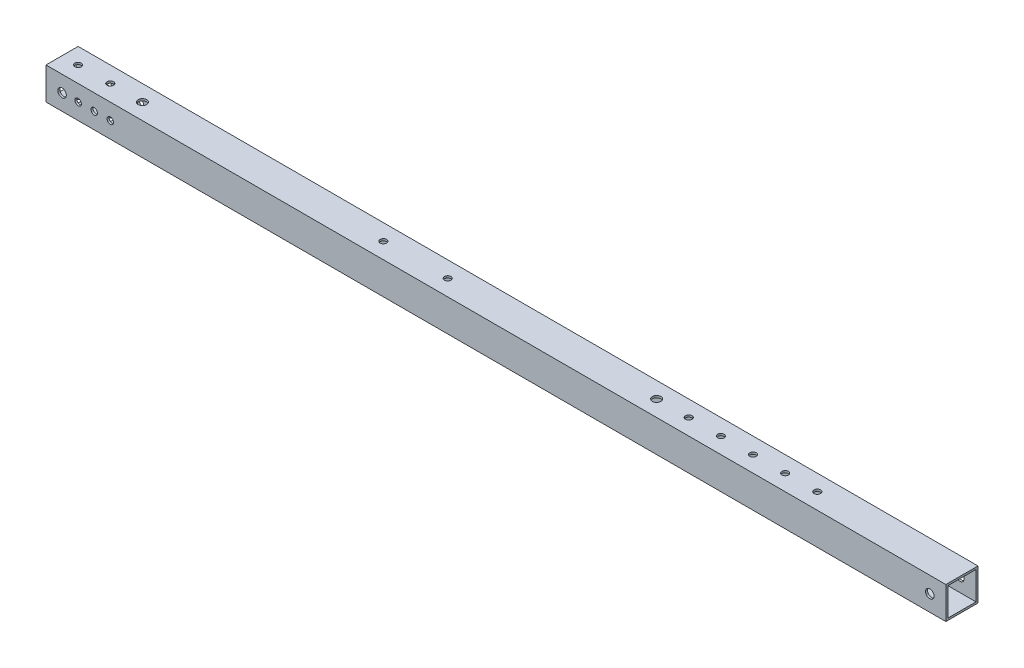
from build123d import *

# Parameters (mm, degrees)
SKETCH1_W                        = 25.4
SKETCH1_H                        = 25.4
SKETCH1_W_2                      = 22.225
SKETCH1_H_2                      = 22.225
BOSS_EXTRUDE1_DEPTH              = 711.2
F_7_0_201_DIAMETER_HOLE1_D       = 5.1054
F_7_0_201_DIAMETER_HOLE2_D       = 5.1054
F_17_64_0_26563_DIAMETER_HOLE1_D = 6.747002
F_17_64_0_26563_DIAMETER_HOLE2_D = 6.747002
F_17_64_0_26563_DIAMETER_HOLE3_D = 6.747002


with BuildPart() as part:
    # Sketch1 → Boss-Extrude1 (new body)
    with BuildSketch(Plane(origin=(0, 0, 0), x_dir=(0, 0, -1), z_dir=(1, 0, 0))):
        Rectangle(SKETCH1_W, SKETCH1_H)
        Rectangle(SKETCH1_W_2, SKETCH1_H_2, mode=Mode.SUBTRACT)
    extrude(amount=BOSS_EXTRUDE1_DEPTH)

    # 7 _0.201_ Diameter Hole1 (through all)
    with Locations(Plane.XY.offset(12.7)):
        with Locations((12.7, 0), (25.4, 0), (38.1, 0), (50.8, 0)):
            Hole(F_7_0_201_DIAMETER_HOLE1_D / 2)

    # 7 _0.201_ Diameter Hole2 (through all)
    with Locations(Plane(origin=(0, 12.7, 0), x_dir=(1, 0, 0), z_dir=(0, 1, 0))):
        with Locations((12.7, 0), (38.1, 0), (596.9, 0), (254, 0), (571.5, 0), (546.1, 0), (520.7, 0), (495.3, 0), (304.8, 0)):
            Hole(F_7_0_201_DIAMETER_HOLE2_D / 2)

    # 17_64 _0.26563_ Diameter Hole1 (through all)
    with Locations(Plane(origin=(0, 12.7, 0), x_dir=(1, 0, 0), z_dir=(0, 1, 0))):
        with Locations((469.9, 0), (63.5, 0)):
            Hole(F_17_64_0_26563_DIAMETER_HOLE1_D / 2)

    # 17_64 _0.26563_ Diameter Hole2 (through all)
    with Locations(Plane.XY.offset(12.7)):
        with Locations((698.5, 0)):
            Hole(F_17_64_0_26563_DIAMETER_HOLE2_D / 2)

    # 17_64 _0.26563_ Diameter Hole3 (through all)
    with Locations(Plane.XY.offset(12.7)):
        with Locations((12.7, 0)):
            Hole(F_17_64_0_26563_DIAMETER_HOLE3_D / 2)


solid = part.part
